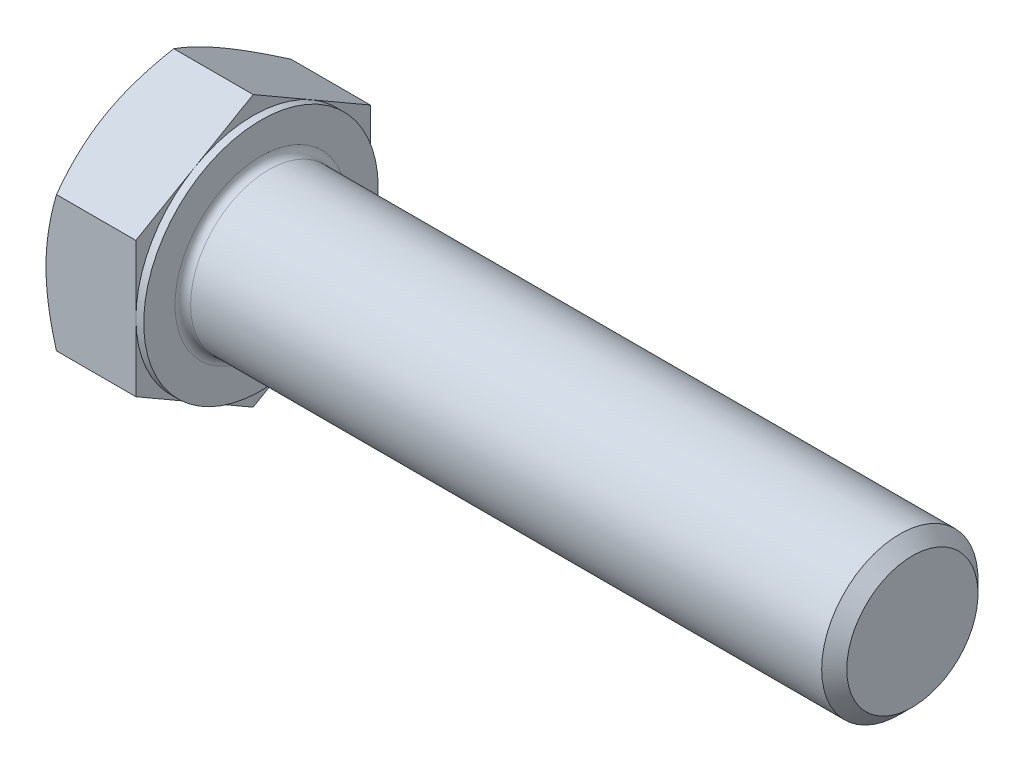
ISO-10303-21;
HEADER;
FILE_DESCRIPTION(('STEP AP214'),'2;1');
FILE_NAME('part.step','',(''),(''),'','','');
FILE_SCHEMA(('AUTOMOTIVE_DESIGN { 1 0 10303 214 1 1 1 1 }'));
ENDSEC;
DATA;
#1=APPLICATION_CONTEXT('core data for automotive mechanical design processes');
#2=APPLICATION_PROTOCOL_DEFINITION('international standard','automotive_design',2000,#1);
#3=PRODUCT_CONTEXT('',#1,'mechanical');
#4=PRODUCT('Part','Part','',(#3));
#5=PRODUCT_RELATED_PRODUCT_CATEGORY('part','',(#4));
#6=PRODUCT_DEFINITION_FORMATION('','',#4);
#7=PRODUCT_DEFINITION_CONTEXT('part definition',#1,'design');
#8=PRODUCT_DEFINITION('design','',#6,#7);
#9=PRODUCT_DEFINITION_SHAPE('','',#8);
#10=(LENGTH_UNIT() NAMED_UNIT(*) SI_UNIT(.MILLI.,.METRE.));
#11=(NAMED_UNIT(*) PLANE_ANGLE_UNIT() SI_UNIT($,.RADIAN.));
#12=(NAMED_UNIT(*) SI_UNIT($,.STERADIAN.) SOLID_ANGLE_UNIT());
#13=UNCERTAINTY_MEASURE_WITH_UNIT(LENGTH_MEASURE(1.E-05),#10,'distance_accuracy_value','');
#14=(GEOMETRIC_REPRESENTATION_CONTEXT(3) GLOBAL_UNCERTAINTY_ASSIGNED_CONTEXT((#13)) GLOBAL_UNIT_ASSIGNED_CONTEXT((#10,
#11,#12)) REPRESENTATION_CONTEXT('',''));
#15=CARTESIAN_POINT('',(0.,0.,0.));
#16=DIRECTION('',(0.,0.,1.));
#17=DIRECTION('',(1.,0.,0.));
#18=AXIS2_PLACEMENT_3D('',#15,#16,#17);
#19=CARTESIAN_POINT('',(7.5,10.3923048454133,0.));
#20=DIRECTION('',(1.,0.,0.));
#21=DIRECTION('',(0.,0.,-1.));
#22=AXIS2_PLACEMENT_3D('',#19,#20,#21);
#23=PLANE('',#22);
#24=CARTESIAN_POINT('',(7.5,0.,0.));
#25=DIRECTION('',(1.,0.,0.));
#26=DIRECTION('',(0.,0.,-1.));
#27=AXIS2_PLACEMENT_3D('',#24,#25,#26);
#28=CIRCLE('',#27,6.6);
#29=CARTESIAN_POINT('',(7.5,0.,-6.6));
#30=VERTEX_POINT('',#29);
#31=EDGE_CURVE('E39',#30,#30,#28,.F.);
#32=ORIENTED_EDGE('',*,*,#31,.T.);
#33=EDGE_LOOP('',(#32));
#34=FACE_BOUND('',#33,.T.);
#35=CARTESIAN_POINT('',(7.5,0.,0.));
#36=DIRECTION('',(1.,0.,0.));
#37=DIRECTION('',(0.,0.,-1.));
#38=AXIS2_PLACEMENT_3D('',#35,#36,#37);
#39=CIRCLE('',#38,9.);
#40=CARTESIAN_POINT('',(7.5,0.,-9.));
#41=VERTEX_POINT('',#40);
#42=EDGE_CURVE('E290',#41,#41,#39,.T.);
#43=ORIENTED_EDGE('',*,*,#42,.T.);
#44=EDGE_LOOP('',(#43));
#45=FACE_BOUND('',#44,.T.);
#46=ADVANCED_FACE('F31',(#34,#45),#23,.T.);
#47=CARTESIAN_POINT('',(0.,0.,0.));
#48=DIRECTION('',(-1.,0.,0.));
#49=DIRECTION('',(0.,0.,1.));
#50=AXIS2_PLACEMENT_3D('',#47,#48,#49);
#51=CYLINDRICAL_SURFACE('',#50,6.);
#52=CARTESIAN_POINT('',(8.1,0.,0.));
#53=DIRECTION('',(1.,0.,0.));
#54=DIRECTION('',(0.,0.,-1.));
#55=AXIS2_PLACEMENT_3D('',#52,#53,#54);
#56=CIRCLE('',#55,6.);
#57=CARTESIAN_POINT('',(8.1,0.,-6.));
#58=VERTEX_POINT('',#57);
#59=EDGE_CURVE('E11',#58,#58,#56,.T.);
#60=ORIENTED_EDGE('',*,*,#59,.T.);
#61=EDGE_LOOP('',(#60));
#62=FACE_BOUND('',#61,.T.);
#63=CARTESIAN_POINT('',(56.536,0.,0.));
#64=DIRECTION('',(-1.,0.,0.));
#65=DIRECTION('',(0.,0.,1.));
#66=AXIS2_PLACEMENT_3D('',#63,#64,#65);
#67=CIRCLE('',#66,6.);
#68=CARTESIAN_POINT('',(56.536,0.,6.));
#69=VERTEX_POINT('',#68);
#70=EDGE_CURVE('E269',#69,#69,#67,.T.);
#71=ORIENTED_EDGE('',*,*,#70,.T.);
#72=EDGE_LOOP('',(#71));
#73=FACE_BOUND('',#72,.T.);
#74=ADVANCED_FACE('F243',(#62,#73),#51,.T.);
#75=CARTESIAN_POINT('',(57.5,0.,0.));
#76=DIRECTION('',(-1.,0.,0.));
#77=DIRECTION('',(0.,0.,1.));
#78=AXIS2_PLACEMENT_3D('',#75,#76,#77);
#79=CONICAL_SURFACE('',#78,5.036,0.785398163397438);
#80=ORIENTED_EDGE('',*,*,#70,.F.);
#81=EDGE_LOOP('',(#80));
#82=FACE_BOUND('',#81,.T.);
#83=CARTESIAN_POINT('',(57.5,0.,0.));
#84=DIRECTION('',(-1.,0.,0.));
#85=DIRECTION('',(0.,0.,1.));
#86=AXIS2_PLACEMENT_3D('',#83,#84,#85);
#87=CIRCLE('',#86,5.036);
#88=CARTESIAN_POINT('',(57.5,0.,5.036));
#89=VERTEX_POINT('',#88);
#90=EDGE_CURVE('E267',#89,#89,#87,.T.);
#91=ORIENTED_EDGE('',*,*,#90,.T.);
#92=EDGE_LOOP('',(#91));
#93=FACE_BOUND('',#92,.T.);
#94=ADVANCED_FACE('F248',(#82,#93),#79,.T.);
#95=CARTESIAN_POINT('',(57.5,0.,0.));
#96=DIRECTION('',(-1.,0.,0.));
#97=DIRECTION('',(0.,0.,1.));
#98=AXIS2_PLACEMENT_3D('',#95,#96,#97);
#99=PLANE('',#98);
#100=ORIENTED_EDGE('',*,*,#90,.F.);
#101=EDGE_LOOP('',(#100));
#102=FACE_BOUND('',#101,.T.);
#103=ADVANCED_FACE('F255',(#102),#99,.F.);
#104=CARTESIAN_POINT('',(6.9,9.,0.));
#105=DIRECTION('',(1.,0.,0.));
#106=DIRECTION('',(0.,0.,-1.));
#107=AXIS2_PLACEMENT_3D('',#104,#105,#106);
#108=PLANE('',#107);
#109=DIRECTION('',(0.,0.500000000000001,0.866025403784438));
#110=VECTOR('',#109,1.);
#111=CARTESIAN_POINT('',(6.9,5.19615242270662,-9.));
#112=LINE('',#111,#110);
#113=CARTESIAN_POINT('',(6.9,5.19615242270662,-9.));
#114=VERTEX_POINT('',#113);
#115=CARTESIAN_POINT('',(6.9,7.79422863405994,-4.50000000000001));
#116=VERTEX_POINT('',#115);
#117=EDGE_CURVE('E163',#114,#116,#112,.T.);
#118=ORIENTED_EDGE('',*,*,#117,.T.);
#119=CARTESIAN_POINT('',(6.9,0.,0.));
#120=DIRECTION('',(-1.,0.,0.));
#121=DIRECTION('',(0.,0.,1.));
#122=AXIS2_PLACEMENT_3D('',#119,#120,#121);
#123=CIRCLE('',#122,9.);
#124=CARTESIAN_POINT('',(6.9,0.,-9.));
#125=VERTEX_POINT('',#124);
#126=EDGE_CURVE('E46',#116,#125,#123,.T.);
#127=ORIENTED_EDGE('',*,*,#126,.T.);
#128=DIRECTION('',(0.,1.,0.));
#129=VECTOR('',#128,1.);
#130=CARTESIAN_POINT('',(6.9,5.19615242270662,-9.));
#131=LINE('',#130,#129);
#132=EDGE_CURVE('E293',#125,#114,#131,.T.);
#133=ORIENTED_EDGE('',*,*,#132,.T.);
#134=EDGE_LOOP('',(#118,#127,#133));
#135=FACE_BOUND('',#134,.T.);
#136=ADVANCED_FACE('F258',(#135),#108,.T.);
#137=CARTESIAN_POINT('',(6.9,10.3923048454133,0.));
#138=VERTEX_POINT('',#137);
#139=EDGE_CURVE('E161',#116,#138,#112,.T.);
#140=ORIENTED_EDGE('',*,*,#139,.T.);
#141=DIRECTION('',(0.,-0.500000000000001,0.866025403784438));
#142=VECTOR('',#141,1.);
#143=CARTESIAN_POINT('',(6.9,10.3923048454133,0.));
#144=LINE('',#143,#142);
#145=CARTESIAN_POINT('',(6.9,7.79422863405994,4.50000000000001));
#146=VERTEX_POINT('',#145);
#147=EDGE_CURVE('E160',#138,#146,#144,.T.);
#148=ORIENTED_EDGE('',*,*,#147,.T.);
#149=EDGE_CURVE('E149',#146,#116,#123,.T.);
#150=ORIENTED_EDGE('',*,*,#149,.T.);
#151=EDGE_LOOP('',(#140,#148,#150));
#152=FACE_BOUND('',#151,.T.);
#153=ADVANCED_FACE('F263',(#152),#108,.T.);
#154=CARTESIAN_POINT('',(6.9,5.19615242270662,9.));
#155=VERTEX_POINT('',#154);
#156=EDGE_CURVE('E128',#146,#155,#144,.T.);
#157=ORIENTED_EDGE('',*,*,#156,.T.);
#158=DIRECTION('',(0.,-1.,0.));
#159=VECTOR('',#158,1.);
#160=CARTESIAN_POINT('',(6.9,5.19615242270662,9.));
#161=LINE('',#160,#159);
#162=CARTESIAN_POINT('',(6.9,0.,9.));
#163=VERTEX_POINT('',#162);
#164=EDGE_CURVE('E122',#155,#163,#161,.T.);
#165=ORIENTED_EDGE('',*,*,#164,.T.);
#166=EDGE_CURVE('E126',#163,#146,#123,.T.);
#167=ORIENTED_EDGE('',*,*,#166,.T.);
#168=EDGE_LOOP('',(#157,#165,#167));
#169=FACE_BOUND('',#168,.T.);
#170=ADVANCED_FACE('F124',(#169),#108,.T.);
#171=CARTESIAN_POINT('',(6.9,-5.19615242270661,9.));
#172=VERTEX_POINT('',#171);
#173=EDGE_CURVE('E132',#163,#172,#161,.T.);
#174=ORIENTED_EDGE('',*,*,#173,.T.);
#175=DIRECTION('',(0.,-0.500000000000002,-0.866025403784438));
#176=VECTOR('',#175,1.);
#177=CARTESIAN_POINT('',(6.9,-10.3923048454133,0.));
#178=LINE('',#177,#176);
#179=CARTESIAN_POINT('',(6.9,-7.79422863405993,4.50000000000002));
#180=VERTEX_POINT('',#179);
#181=EDGE_CURVE('E139',#172,#180,#178,.T.);
#182=ORIENTED_EDGE('',*,*,#181,.T.);
#183=EDGE_CURVE('E136',#180,#163,#123,.T.);
#184=ORIENTED_EDGE('',*,*,#183,.T.);
#185=EDGE_LOOP('',(#174,#182,#184));
#186=FACE_BOUND('',#185,.T.);
#187=ADVANCED_FACE('F137',(#186),#108,.T.);
#188=CARTESIAN_POINT('',(6.9,-10.3923048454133,0.));
#189=VERTEX_POINT('',#188);
#190=EDGE_CURVE('E155',#180,#189,#178,.T.);
#191=ORIENTED_EDGE('',*,*,#190,.T.);
#192=DIRECTION('',(0.,0.5,-0.866025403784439));
#193=VECTOR('',#192,1.);
#194=CARTESIAN_POINT('',(6.9,-5.19615242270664,-9.));
#195=LINE('',#194,#193);
#196=CARTESIAN_POINT('',(6.9,-7.79422863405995,-4.49999999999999));
#197=VERTEX_POINT('',#196);
#198=EDGE_CURVE('E331',#189,#197,#195,.T.);
#199=ORIENTED_EDGE('',*,*,#198,.T.);
#200=EDGE_CURVE('E143',#197,#180,#123,.T.);
#201=ORIENTED_EDGE('',*,*,#200,.T.);
#202=EDGE_LOOP('',(#191,#199,#201));
#203=FACE_BOUND('',#202,.T.);
#204=ADVANCED_FACE('F332',(#203),#108,.T.);
#205=CARTESIAN_POINT('',(6.9,-5.19615242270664,-9.));
#206=VERTEX_POINT('',#205);
#207=EDGE_CURVE('E150',#197,#206,#195,.T.);
#208=ORIENTED_EDGE('',*,*,#207,.T.);
#209=EDGE_CURVE('E294',#206,#125,#131,.T.);
#210=ORIENTED_EDGE('',*,*,#209,.T.);
#211=EDGE_CURVE('E301',#125,#197,#123,.T.);
#212=ORIENTED_EDGE('',*,*,#211,.T.);
#213=EDGE_LOOP('',(#208,#210,#212));
#214=FACE_BOUND('',#213,.T.);
#215=ADVANCED_FACE('F264',(#214),#108,.T.);
#216=CARTESIAN_POINT('',(0.,0.,0.));
#217=DIRECTION('',(-1.,0.,0.));
#218=DIRECTION('',(0.,0.,1.));
#219=AXIS2_PLACEMENT_3D('',#216,#217,#218);
#220=CYLINDRICAL_SURFACE('',#219,9.);
#221=ORIENTED_EDGE('',*,*,#126,.F.);
#222=ORIENTED_EDGE('',*,*,#149,.F.);
#223=ORIENTED_EDGE('',*,*,#166,.F.);
#224=ORIENTED_EDGE('',*,*,#183,.F.);
#225=ORIENTED_EDGE('',*,*,#200,.F.);
#226=ORIENTED_EDGE('',*,*,#211,.F.);
#227=EDGE_LOOP('',(#221,#222,#223,#224,#225,#226));
#228=FACE_BOUND('',#227,.T.);
#229=ORIENTED_EDGE('',*,*,#42,.F.);
#230=EDGE_LOOP('',(#229));
#231=FACE_BOUND('',#230,.T.);
#232=ADVANCED_FACE('F146',(#228,#231),#220,.T.);
#233=CARTESIAN_POINT('',(0.,10.3923048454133,0.));
#234=DIRECTION('',(1.,0.,0.));
#235=DIRECTION('',(0.,0.,-1.));
#236=AXIS2_PLACEMENT_3D('',#233,#234,#235);
#237=PLANE('',#236);
#238=CARTESIAN_POINT('',(0.,0.,0.));
#239=DIRECTION('',(1.,0.,0.));
#240=DIRECTION('',(0.,0.,-1.));
#241=AXIS2_PLACEMENT_3D('',#238,#239,#240);
#242=CIRCLE('',#241,9.);
#243=CARTESIAN_POINT('',(0.,0.,-9.));
#244=VERTEX_POINT('',#243);
#245=CARTESIAN_POINT('',(0.,7.79422863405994,-4.50000000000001));
#246=VERTEX_POINT('',#245);
#247=EDGE_CURVE('E289',#244,#246,#242,.T.);
#248=ORIENTED_EDGE('',*,*,#247,.F.);
#249=CARTESIAN_POINT('',(0.,-7.79422863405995,-4.5));
#250=VERTEX_POINT('',#249);
#251=EDGE_CURVE('E285',#250,#244,#242,.T.);
#252=ORIENTED_EDGE('',*,*,#251,.F.);
#253=CARTESIAN_POINT('',(0.,-7.79422863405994,4.50000000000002));
#254=VERTEX_POINT('',#253);
#255=EDGE_CURVE('E288',#254,#250,#242,.T.);
#256=ORIENTED_EDGE('',*,*,#255,.F.);
#257=CARTESIAN_POINT('',(0.,0.,9.));
#258=VERTEX_POINT('',#257);
#259=EDGE_CURVE('E324',#258,#254,#242,.T.);
#260=ORIENTED_EDGE('',*,*,#259,.F.);
#261=CARTESIAN_POINT('',(0.,0.,0.));
#262=DIRECTION('',(-1.,0.,0.));
#263=DIRECTION('',(0.,0.,1.));
#264=AXIS2_PLACEMENT_3D('',#261,#262,#263);
#265=CIRCLE('',#264,9.);
#266=CARTESIAN_POINT('',(0.,7.79422863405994,4.50000000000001));
#267=VERTEX_POINT('',#266);
#268=EDGE_CURVE('E164',#258,#267,#265,.T.);
#269=ORIENTED_EDGE('',*,*,#268,.T.);
#270=EDGE_CURVE('E347',#246,#267,#242,.T.);
#271=ORIENTED_EDGE('',*,*,#270,.F.);
#272=EDGE_LOOP('',(#248,#252,#256,#260,#269,#271));
#273=FACE_BOUND('',#272,.T.);
#274=ADVANCED_FACE('F193',(#273),#237,.F.);
#275=CARTESIAN_POINT('',(0.,0.,0.));
#276=DIRECTION('',(1.,0.,0.));
#277=DIRECTION('',(0.,0.,-1.));
#278=AXIS2_PLACEMENT_3D('',#275,#276,#277);
#279=CONICAL_SURFACE('',#278,9.,1.0471975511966);
#280=CARTESIAN_POINT('',(0.803914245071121,5.19603695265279,9.0002));
#281=CARTESIAN_POINT('',(0.737982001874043,5.31024090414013,8.80239295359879));
#282=CARTESIAN_POINT('',(0.675041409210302,5.42489028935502,8.60381439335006));
#283=CARTESIAN_POINT('',(0.555968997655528,5.65512011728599,8.20504463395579));
#284=CARTESIAN_POINT('',(0.499840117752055,5.77070093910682,8.00485277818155));
#285=CARTESIAN_POINT('',(0.395151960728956,6.00300811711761,7.60248494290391));
#286=CARTESIAN_POINT('',(0.34661077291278,6.11973652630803,7.40030540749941));
#287=CARTESIAN_POINT('',(0.258148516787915,6.35398725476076,6.99457124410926));
#288=CARTESIAN_POINT('',(0.218225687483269,6.47150940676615,6.7910169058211));
#289=CARTESIAN_POINT('',(0.148684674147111,6.70436794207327,6.38769409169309));
#290=CARTESIAN_POINT('',(0.118837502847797,6.81968712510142,6.187955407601));
#291=CARTESIAN_POINT('',(0.0687933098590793,7.05084147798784,5.78758432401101));
#292=CARTESIAN_POINT('',(0.0485954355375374,7.16667660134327,5.5869520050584));
#293=CARTESIAN_POINT('',(0.0183543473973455,7.39854776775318,5.18533936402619));
#294=CARTESIAN_POINT('',(0.0082996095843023,7.51458343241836,4.98435969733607));
#295=CARTESIAN_POINT('',(-0.0014376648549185,7.74676155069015,4.58221540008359));
#296=CARTESIAN_POINT('',(-0.00112052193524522,7.86290400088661,4.38105077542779));
#297=CARTESIAN_POINT('',(0.00916395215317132,8.08003584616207,4.00496738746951));
#298=CARTESIAN_POINT('',(0.0178767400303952,8.18104055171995,3.83002210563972));
#299=CARTESIAN_POINT('',(0.0429773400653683,8.38281337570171,3.48054132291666));
#300=CARTESIAN_POINT('',(0.0593656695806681,8.4835814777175,3.30600585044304));
#301=CARTESIAN_POINT('',(0.119656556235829,8.7854956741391,2.7830751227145));
#302=CARTESIAN_POINT('',(0.174677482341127,8.98610736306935,2.43560548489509));
#303=CARTESIAN_POINT('',(0.312230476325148,9.38945876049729,1.736980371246));
#304=CARTESIAN_POINT('',(0.395345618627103,9.59214699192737,1.38591405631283));
#305=CARTESIAN_POINT('',(0.583982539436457,9.99450087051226,0.689016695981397));
#306=CARTESIAN_POINT('',(0.689460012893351,10.1941716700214,0.343176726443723));
#307=CARTESIAN_POINT('',(0.803914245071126,10.3924203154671,-0.000200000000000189));
#308=B_SPLINE_CURVE_WITH_KNOTS('',3,(#280,#281,#282,#283,#284,#285,#286,#287,#288,#289,#290,
#291,#292,#293,#294,#295,#296,#297,#298,#299,#300,#301,#302,#303,#304,#305,#306,#307),
.UNSPECIFIED.,.F.,.F.,(4,2,2,2,2,2,2,2,2,2,2,2,2,4),(0.,0.713219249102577,1.42674513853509,
2.14194697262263,2.8570025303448,3.55449749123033,4.25193080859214,4.94857085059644,
5.64518936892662,6.25162976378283,6.8581110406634,8.07193747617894,9.31268391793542,
10.5509947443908),.UNSPECIFIED.);
#309=CARTESIAN_POINT('',(0.80384757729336,10.3923048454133,0.));
#310=VERTEX_POINT('',#309);
#311=EDGE_CURVE('E212',#267,#310,#308,.T.);
#312=ORIENTED_EDGE('',*,*,#311,.T.);
#313=CARTESIAN_POINT('',(0.803914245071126,10.3924203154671,0.000200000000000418));
#314=CARTESIAN_POINT('',(0.737982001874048,10.2782163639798,-0.197607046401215));
#315=CARTESIAN_POINT('',(0.675041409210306,10.1635669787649,-0.396185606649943));
#316=CARTESIAN_POINT('',(0.555968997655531,9.93333715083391,-0.794955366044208));
#317=CARTESIAN_POINT('',(0.499840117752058,9.81775632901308,-0.995147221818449));
#318=CARTESIAN_POINT('',(0.395151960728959,9.58544915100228,-1.39751505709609));
#319=CARTESIAN_POINT('',(0.346610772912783,9.46872074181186,-1.59969459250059));
#320=CARTESIAN_POINT('',(0.258148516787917,9.23447001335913,-2.00542875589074));
#321=CARTESIAN_POINT('',(0.218225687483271,9.11694786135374,-2.20898309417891));
#322=CARTESIAN_POINT('',(0.148684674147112,8.88408932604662,-2.61230590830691));
#323=CARTESIAN_POINT('',(0.118837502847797,8.76877014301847,-2.812044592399));
#324=CARTESIAN_POINT('',(0.0687933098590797,8.53761579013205,-3.21241567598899));
#325=CARTESIAN_POINT('',(0.0485954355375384,8.42178066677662,-3.4130479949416));
#326=CARTESIAN_POINT('',(0.0183543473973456,8.18990950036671,-3.81466063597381));
#327=CARTESIAN_POINT('',(0.00829960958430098,8.07387383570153,-4.01564030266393));
#328=CARTESIAN_POINT('',(-0.00143766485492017,7.84169571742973,-4.41778459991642));
#329=CARTESIAN_POINT('',(-0.00112052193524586,7.72555326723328,-4.61894922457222));
#330=CARTESIAN_POINT('',(0.00916395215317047,7.50842142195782,-4.9950326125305));
#331=CARTESIAN_POINT('',(0.0178767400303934,7.40741671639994,-5.16997789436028));
#332=CARTESIAN_POINT('',(0.0429773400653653,7.20564389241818,-5.51945867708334));
#333=CARTESIAN_POINT('',(0.059365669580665,7.10487579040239,-5.69399414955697));
#334=CARTESIAN_POINT('',(0.119656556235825,6.80296159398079,-6.2169248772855));
#335=CARTESIAN_POINT('',(0.174677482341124,6.60234990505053,-6.56439451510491));
#336=CARTESIAN_POINT('',(0.312230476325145,6.1989985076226,-7.263019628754));
#337=CARTESIAN_POINT('',(0.3953456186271,5.99631027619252,-7.61408594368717));
#338=CARTESIAN_POINT('',(0.583982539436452,5.59395639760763,-8.3109833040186));
#339=CARTESIAN_POINT('',(0.689460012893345,5.39428559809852,-8.65682327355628));
#340=CARTESIAN_POINT('',(0.803914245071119,5.19603695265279,-9.0002));
#341=B_SPLINE_CURVE_WITH_KNOTS('',3,(#313,#314,#315,#316,#317,#318,#319,#320,#321,#322,#323,
#324,#325,#326,#327,#328,#329,#330,#331,#332,#333,#334,#335,#336,#337,#338,#339,#340),
.UNSPECIFIED.,.F.,.F.,(4,2,2,2,2,2,2,2,2,2,2,2,2,4),(0.,0.713219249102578,1.42674513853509,
2.14194697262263,2.8570025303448,3.55449749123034,4.25193080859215,4.94857085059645,
5.64518936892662,6.25162976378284,6.8581110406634,8.07193747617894,9.31268391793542,
10.5509947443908),.UNSPECIFIED.);
#342=EDGE_CURVE('E54',#310,#246,#341,.T.);
#343=ORIENTED_EDGE('',*,*,#342,.T.);
#344=ORIENTED_EDGE('',*,*,#270,.T.);
#345=EDGE_LOOP('',(#312,#343,#344));
#346=FACE_BOUND('',#345,.T.);
#347=ADVANCED_FACE('F348',(#346),#279,.T.);
#348=CARTESIAN_POINT('',(4.50308345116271,-14.1853984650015,8.99999999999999));
#349=CARTESIAN_POINT('',(4.31054430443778,-13.7903499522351,8.99999999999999));
#350=CARTESIAN_POINT('',(4.11978647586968,-13.3944187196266,8.99999999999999));
#351=CARTESIAN_POINT('',(3.74283090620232,-12.6003222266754,8.99999999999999));
#352=CARTESIAN_POINT('',(3.55663384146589,-12.2021566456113,9.));
#353=CARTESIAN_POINT('',(3.18890856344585,-11.4011783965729,9.));
#354=CARTESIAN_POINT('',(3.00740939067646,-10.9983523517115,9.));
#355=CARTESIAN_POINT('',(2.65153988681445,-10.1895752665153,9.));
#356=CARTESIAN_POINT('',(2.4771692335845,-9.78362436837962,9.));
#357=CARTESIAN_POINT('',(2.13161244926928,-8.953981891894,9.));
#358=CARTESIAN_POINT('',(1.96074001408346,-8.53015895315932,9.));
#359=CARTESIAN_POINT('',(1.63138410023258,-7.6776404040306,9.));
#360=CARTESIAN_POINT('',(1.47290197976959,-7.24894426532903,9.));
#361=CARTESIAN_POINT('',(1.17232155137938,-6.38672363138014,9.));
#362=CARTESIAN_POINT('',(1.03019194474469,-5.95321016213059,9.));
#363=CARTESIAN_POINT('',(0.766724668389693,-5.07998336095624,9.));
#364=CARTESIAN_POINT('',(0.645380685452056,-4.64027195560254,9.));
#365=CARTESIAN_POINT('',(0.429822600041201,-3.75682505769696,9.));
#366=CARTESIAN_POINT('',(0.335452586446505,-3.31312863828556,9.));
#367=CARTESIAN_POINT('',(0.218090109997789,-2.64336713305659,9.));
#368=CARTESIAN_POINT('',(0.182999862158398,-2.41939560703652,9.));
#369=CARTESIAN_POINT('',(0.121565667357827,-1.9702635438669,9.));
#370=CARTESIAN_POINT('',(0.0952208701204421,-1.74510312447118,9.));
#371=CARTESIAN_POINT('',(0.0521451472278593,-1.29693480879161,9.));
#372=CARTESIAN_POINT('',(0.0352889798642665,-1.07393900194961,9.));
#373=CARTESIAN_POINT('',(0.0110310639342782,-0.627433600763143,9.));
#374=CARTESIAN_POINT('',(0.00362915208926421,-0.403924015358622,9.));
#375=CARTESIAN_POINT('',(-0.00154262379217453,0.0432079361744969,9.));
#376=CARTESIAN_POINT('',(0.000687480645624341,0.266830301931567,9.));
#377=CARTESIAN_POINT('',(0.0147226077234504,0.713776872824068,9.));
#378=CARTESIAN_POINT('',(0.0265280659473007,0.937101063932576,9.));
#379=CARTESIAN_POINT('',(0.065650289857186,1.46707211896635,9.));
#380=CARTESIAN_POINT('',(0.0971347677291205,1.77341845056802,9.));
#381=CARTESIAN_POINT('',(0.176454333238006,2.38397028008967,9.));
#382=CARTESIAN_POINT('',(0.224291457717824,2.68817550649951,9.));
#383=CARTESIAN_POINT('',(0.389806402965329,3.59715813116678,9.));
#384=CARTESIAN_POINT('',(0.529461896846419,4.19799412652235,9.));
#385=CARTESIAN_POINT('',(0.773331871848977,5.09670706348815,9.));
#386=CARTESIAN_POINT('',(0.861532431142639,5.399199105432,9.));
#387=CARTESIAN_POINT('',(1.04752099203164,6.00125026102,9.));
#388=CARTESIAN_POINT('',(1.14530906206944,6.3008093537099,9.));
#389=CARTESIAN_POINT('',(1.34886866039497,6.89708058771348,9.));
#390=CARTESIAN_POINT('',(1.45463787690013,7.19379352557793,9.));
#391=CARTESIAN_POINT('',(1.67287301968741,7.78473287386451,9.));
#392=CARTESIAN_POINT('',(1.78533883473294,8.07895932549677,9.));
#393=CARTESIAN_POINT('',(2.07523735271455,8.81619444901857,9.));
#394=CARTESIAN_POINT('',(2.25629467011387,9.25777584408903,9.));
#395=CARTESIAN_POINT('',(2.62827522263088,10.1367776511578,9.));
#396=CARTESIAN_POINT('',(2.81919928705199,10.5741977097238,9.));
#397=CARTESIAN_POINT('',(3.20877963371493,11.4457286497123,9.));
#398=CARTESIAN_POINT('',(3.40743823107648,11.8798384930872,9.));
#399=CARTESIAN_POINT('',(3.81079737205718,12.7452179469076,9.));
#400=CARTESIAN_POINT('',(4.01549773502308,13.176487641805,9.00000000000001));
#401=CARTESIAN_POINT('',(4.43000777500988,14.0372827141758,9.00000000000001));
#402=CARTESIAN_POINT('',(4.63982402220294,14.466804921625,9.00000000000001));
#403=CARTESIAN_POINT('',(5.0633687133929,15.3239162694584,9.00000000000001));
#404=CARTESIAN_POINT('',(5.27709718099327,15.7515053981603,9.00000000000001));
#405=CARTESIAN_POINT('',(5.70771289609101,16.6049951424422,9.00000000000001));
#406=CARTESIAN_POINT('',(5.92459958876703,17.0308960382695,9.00000000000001));
#407=CARTESIAN_POINT('',(6.36101693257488,17.8813418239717,9.00000000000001));
#408=CARTESIAN_POINT('',(6.58054759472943,18.305886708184,9.00000000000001));
#409=CARTESIAN_POINT('',(7.2009668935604,19.4981240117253,9.00000000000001));
#410=CARTESIAN_POINT('',(7.60436223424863,20.2645118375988,9.00000000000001));
#411=CARTESIAN_POINT('',(8.41646747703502,21.7945065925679,9.00000000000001));
#412=CARTESIAN_POINT('',(8.82517763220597,22.558113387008,9.00000000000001));
#413=CARTESIAN_POINT('',(9.64538992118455,24.0808854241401,9.00000000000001));
#414=CARTESIAN_POINT('',(10.0568800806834,24.8400571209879,9.00000000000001));
#415=CARTESIAN_POINT('',(10.6764233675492,25.9775231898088,9.00000000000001));
#416=CARTESIAN_POINT('',(10.8833155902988,26.3564507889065,9.00000000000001));
#417=CARTESIAN_POINT('',(11.2977907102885,27.1139273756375,9.00000000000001));
#418=CARTESIAN_POINT('',(11.5053736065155,27.492476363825,9.00000000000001));
#419=CARTESIAN_POINT('',(11.7132605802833,27.8708583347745,9.00000000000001));
#420=B_SPLINE_CURVE_WITH_KNOTS('',3,(#348,#349,#350,#351,#352,#353,#354,#355,#356,#357,#358,
#359,#360,#361,#362,#363,#364,#365,#366,#367,#368,#369,#370,#371,#372,#373,#374,#375,#376,#377,
#378,#379,#380,#381,#382,#383,#384,#385,#386,#387,#388,#389,#390,#391,#392,#393,#394,#395,#396,
#397,#398,#399,#400,#401,#402,#403,#404,#405,#406,#407,#408,#409,#410,#411,#412,#413,#414,#415,
#416,#417,#418,#419),.UNSPECIFIED.,.F.,.F.,(4,2,2,2,2,2,2,2,2,2,2,2,2,2,2,2,2,2,2,2,2,2,2,2,2,2,
2,2,2,2,2,2,2,2,2,4),(0.,1.31842765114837,2.6370496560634,3.96247407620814,5.28783853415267,
6.65860358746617,8.02951869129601,9.39776460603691,10.7655942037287,12.1253499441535,
12.8053173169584,13.4852185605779,14.1559216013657,14.8266130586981,15.4973023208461,
16.1680220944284,17.0913849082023,18.0148627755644,19.862742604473,20.8079230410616,
21.7531102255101,22.6980246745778,23.6429234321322,25.0745302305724,26.5062575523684,
27.9384167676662,29.3705332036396,30.8045973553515,32.2386701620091,33.6724940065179,
35.1063238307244,37.7045032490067,40.3028068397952,42.8933552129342,44.1885437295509,
45.4837303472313),.UNSPECIFIED.);
#421=CARTESIAN_POINT('',(0.803847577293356,5.19615242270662,9.));
#422=VERTEX_POINT('',#421);
#423=EDGE_CURVE('E224',#258,#422,#420,.T.);
#424=ORIENTED_EDGE('',*,*,#423,.T.);
#425=EDGE_CURVE('E223',#422,#267,#308,.T.);
#426=ORIENTED_EDGE('',*,*,#425,.T.);
#427=ORIENTED_EDGE('',*,*,#268,.F.);
#428=EDGE_LOOP('',(#424,#426,#427));
#429=FACE_BOUND('',#428,.T.);
#430=ADVANCED_FACE('F318',(#429),#279,.T.);
#431=CARTESIAN_POINT('',(0.80384757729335,-5.19615242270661,9.));
#432=VERTEX_POINT('',#431);
#433=EDGE_CURVE('E270',#432,#258,#420,.T.);
#434=ORIENTED_EDGE('',*,*,#433,.T.);
#435=ORIENTED_EDGE('',*,*,#259,.T.);
#436=CARTESIAN_POINT('',(0.803914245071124,-10.3924203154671,-0.000200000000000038));
#437=CARTESIAN_POINT('',(0.737982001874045,-10.2782163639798,0.197607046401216));
#438=CARTESIAN_POINT('',(0.675041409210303,-10.1635669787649,0.396185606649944));
#439=CARTESIAN_POINT('',(0.555968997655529,-9.9333371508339,0.794955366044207));
#440=CARTESIAN_POINT('',(0.499840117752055,-9.81775632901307,0.995147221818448));
#441=CARTESIAN_POINT('',(0.395151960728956,-9.58544915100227,1.39751505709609));
#442=CARTESIAN_POINT('',(0.34661077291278,-9.46872074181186,1.59969459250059));
#443=CARTESIAN_POINT('',(0.258148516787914,-9.23447001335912,2.00542875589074));
#444=CARTESIAN_POINT('',(0.218225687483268,-9.11694786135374,2.20898309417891));
#445=CARTESIAN_POINT('',(0.148684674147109,-8.88408932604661,2.61230590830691));
#446=CARTESIAN_POINT('',(0.118837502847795,-8.76877014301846,2.812044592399));
#447=CARTESIAN_POINT('',(0.0687933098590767,-8.53761579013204,3.21241567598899));
#448=CARTESIAN_POINT('',(0.048595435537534,-8.42178066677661,3.4130479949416));
#449=CARTESIAN_POINT('',(0.0183543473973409,-8.18990950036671,3.81466063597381));
#450=CARTESIAN_POINT('',(0.0082996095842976,-8.07387383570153,4.01564030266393));
#451=CARTESIAN_POINT('',(-0.00143766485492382,-7.84169571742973,4.41778459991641));
#452=CARTESIAN_POINT('',(-0.00112052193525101,-7.72555326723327,4.61894922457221));
#453=CARTESIAN_POINT('',(0.00916395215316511,-7.50842142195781,4.99503261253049));
#454=CARTESIAN_POINT('',(0.017876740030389,-7.40741671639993,5.16997789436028));
#455=CARTESIAN_POINT('',(0.0429773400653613,-7.20564389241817,5.51945867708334));
#456=CARTESIAN_POINT('',(0.0593656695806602,-7.10487579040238,5.69399414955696));
#457=CARTESIAN_POINT('',(0.119656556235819,-6.80296159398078,6.2169248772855));
#458=CARTESIAN_POINT('',(0.174677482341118,-6.60234990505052,6.56439451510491));
#459=CARTESIAN_POINT('',(0.312230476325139,-6.19899850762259,7.26301962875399));
#460=CARTESIAN_POINT('',(0.395345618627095,-5.99631027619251,7.61408594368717));
#461=CARTESIAN_POINT('',(0.583982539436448,-5.59395639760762,8.3109833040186));
#462=CARTESIAN_POINT('',(0.689460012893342,-5.39428559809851,8.65682327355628));
#463=CARTESIAN_POINT('',(0.803914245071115,-5.19603695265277,9.0002));
#464=B_SPLINE_CURVE_WITH_KNOTS('',3,(#436,#437,#438,#439,#440,#441,#442,#443,#444,#445,#446,
#447,#448,#449,#450,#451,#452,#453,#454,#455,#456,#457,#458,#459,#460,#461,#462,#463),
.UNSPECIFIED.,.F.,.F.,(4,2,2,2,2,2,2,2,2,2,2,2,2,4),(0.,0.713219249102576,1.42674513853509,
2.14194697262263,2.8570025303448,3.55449749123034,4.25193080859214,4.94857085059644,
5.64518936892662,6.25162976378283,6.8581110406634,8.07193747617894,9.31268391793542,
10.5509947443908),.UNSPECIFIED.);
#465=EDGE_CURVE('E214',#254,#432,#464,.T.);
#466=ORIENTED_EDGE('',*,*,#465,.T.);
#467=EDGE_LOOP('',(#434,#435,#466));
#468=FACE_BOUND('',#467,.T.);
#469=ADVANCED_FACE('F182',(#468),#279,.T.);
#470=CARTESIAN_POINT('',(0.803847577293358,-10.3923048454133,0.));
#471=VERTEX_POINT('',#470);
#472=EDGE_CURVE('E207',#471,#254,#464,.T.);
#473=ORIENTED_EDGE('',*,*,#472,.T.);
#474=ORIENTED_EDGE('',*,*,#255,.T.);
#475=CARTESIAN_POINT('',(0.803914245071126,-5.1960369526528,-9.0002));
#476=CARTESIAN_POINT('',(0.737982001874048,-5.31024090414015,-8.80239295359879));
#477=CARTESIAN_POINT('',(0.675041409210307,-5.42489028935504,-8.60381439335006));
#478=CARTESIAN_POINT('',(0.555968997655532,-5.655120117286,-8.20504463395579));
#479=CARTESIAN_POINT('',(0.499840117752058,-5.77070093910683,-8.00485277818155));
#480=CARTESIAN_POINT('',(0.395151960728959,-6.00300811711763,-7.6024849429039));
#481=CARTESIAN_POINT('',(0.346610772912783,-6.11973652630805,-7.4003054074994));
#482=CARTESIAN_POINT('',(0.258148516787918,-6.35398725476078,-6.99457124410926));
#483=CARTESIAN_POINT('',(0.218225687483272,-6.47150940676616,-6.79101690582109));
#484=CARTESIAN_POINT('',(0.148684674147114,-6.70436794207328,-6.38769409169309));
#485=CARTESIAN_POINT('',(0.1188375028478,-6.81968712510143,-6.187955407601));
#486=CARTESIAN_POINT('',(0.0687933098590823,-7.05084147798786,-5.78758432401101));
#487=CARTESIAN_POINT('',(0.04859543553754,-7.16667660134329,-5.58695200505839));
#488=CARTESIAN_POINT('',(0.018354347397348,-7.39854776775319,-5.18533936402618));
#489=CARTESIAN_POINT('',(0.00829960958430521,-7.51458343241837,-4.98435969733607));
#490=CARTESIAN_POINT('',(-0.00143766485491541,-7.74676155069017,-4.58221540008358));
#491=CARTESIAN_POINT('',(-0.00112052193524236,-7.86290400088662,-4.38105077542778));
#492=CARTESIAN_POINT('',(0.00916395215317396,-8.08003584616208,-4.0049673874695));
#493=CARTESIAN_POINT('',(0.0178767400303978,-8.18104055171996,-3.83002210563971));
#494=CARTESIAN_POINT('',(0.0429773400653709,-8.38281337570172,-3.48054132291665));
#495=CARTESIAN_POINT('',(0.0593656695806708,-8.48358147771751,-3.30600585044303));
#496=CARTESIAN_POINT('',(0.119656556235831,-8.7854956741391,-2.7830751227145));
#497=CARTESIAN_POINT('',(0.174677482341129,-8.98610736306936,-2.43560548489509));
#498=CARTESIAN_POINT('',(0.312230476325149,-9.38945876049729,-1.736980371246));
#499=CARTESIAN_POINT('',(0.395345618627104,-9.59214699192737,-1.38591405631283));
#500=CARTESIAN_POINT('',(0.583982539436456,-9.99450087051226,-0.689016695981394));
#501=CARTESIAN_POINT('',(0.68946001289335,-10.1941716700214,-0.343176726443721));
#502=CARTESIAN_POINT('',(0.803914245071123,-10.3924203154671,0.00019999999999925));
#503=B_SPLINE_CURVE_WITH_KNOTS('',3,(#475,#476,#477,#478,#479,#480,#481,#482,#483,#484,#485,
#486,#487,#488,#489,#490,#491,#492,#493,#494,#495,#496,#497,#498,#499,#500,#501,#502),
.UNSPECIFIED.,.F.,.F.,(4,2,2,2,2,2,2,2,2,2,2,2,2,4),(0.,0.713219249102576,1.42674513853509,
2.14194697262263,2.8570025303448,3.55449749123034,4.25193080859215,4.94857085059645,
5.64518936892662,6.25162976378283,6.8581110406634,8.07193747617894,9.31268391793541,
10.5509947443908),.UNSPECIFIED.);
#504=EDGE_CURVE('E213',#250,#471,#503,.T.);
#505=ORIENTED_EDGE('',*,*,#504,.T.);
#506=EDGE_LOOP('',(#473,#474,#505));
#507=FACE_BOUND('',#506,.T.);
#508=ADVANCED_FACE('F346',(#507),#279,.T.);
#509=CARTESIAN_POINT('',(0.803847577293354,5.19615242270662,-9.));
#510=VERTEX_POINT('',#509);
#511=EDGE_CURVE('E215',#246,#510,#341,.T.);
#512=ORIENTED_EDGE('',*,*,#511,.T.);
#513=CARTESIAN_POINT('',(4.50308345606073,-14.1853984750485,-9.));
#514=CARTESIAN_POINT('',(4.31054430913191,-13.7903499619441,-9.));
#515=CARTESIAN_POINT('',(4.11978648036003,-13.3944187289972,-9.));
#516=CARTESIAN_POINT('',(3.74283091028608,-12.6003222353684,-9.));
#517=CARTESIAN_POINT('',(3.55663384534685,-12.2021566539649,-9.));
#518=CARTESIAN_POINT('',(3.18890856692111,-11.4011784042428,-9.));
#519=CARTESIAN_POINT('',(3.00740939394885,-10.998352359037,-9.));
#520=CARTESIAN_POINT('',(2.65153988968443,-10.1895752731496,-9.));
#521=CARTESIAN_POINT('',(2.47716923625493,-9.78362437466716,-9.));
#522=CARTESIAN_POINT('',(2.13161245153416,-8.9539818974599,-9.));
#523=CARTESIAN_POINT('',(1.96074001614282,-8.53015895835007,-9.));
#524=CARTESIAN_POINT('',(1.63138410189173,-7.67764040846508,-9.));
#525=CARTESIAN_POINT('',(1.47290198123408,-7.24894426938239,-9.));
#526=CARTESIAN_POINT('',(1.17232155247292,-6.38672363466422,-9.));
#527=CARTESIAN_POINT('',(1.0301919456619,-5.95321016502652,-9.));
#528=CARTESIAN_POINT('',(0.766724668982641,-5.07998336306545,-9.));
#529=CARTESIAN_POINT('',(0.645380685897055,-4.64027195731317,-9.));
#530=CARTESIAN_POINT('',(0.429822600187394,-3.75682505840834,-9.));
#531=CARTESIAN_POINT('',(0.335452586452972,-3.31312863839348,-9.));
#532=CARTESIAN_POINT('',(0.218090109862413,-2.64336713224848,-9.));
#533=CARTESIAN_POINT('',(0.182999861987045,-2.41939560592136,-9.));
#534=CARTESIAN_POINT('',(0.12156566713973,-1.97026354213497,-9.));
#535=CARTESIAN_POINT('',(0.0952208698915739,-1.74510312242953,-9.));
#536=CARTESIAN_POINT('',(0.052145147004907,-1.29693480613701,-9.));
#537=CARTESIAN_POINT('',(0.0352889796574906,-1.07393899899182,-9.));
#538=CARTESIAN_POINT('',(0.0110310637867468,-0.62743359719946,-9.));
#539=CARTESIAN_POINT('',(0.00362915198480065,-0.403924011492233,-9.));
#540=CARTESIAN_POINT('',(-0.00154262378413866,0.0432079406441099,-9.));
#541=CARTESIAN_POINT('',(0.000687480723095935,0.266830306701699,-9.));
#542=CARTESIAN_POINT('',(0.0147226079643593,0.713776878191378,-9.));
#543=CARTESIAN_POINT('',(0.0265280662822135,0.937101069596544,-9.));
#544=CARTESIAN_POINT('',(0.0656502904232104,1.46707212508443,-9.));
#545=CARTESIAN_POINT('',(0.0971347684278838,1.77341845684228,-9.));
#546=CARTESIAN_POINT('',(0.176454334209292,2.3839702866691,-9.));
#547=CARTESIAN_POINT('',(0.224291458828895,2.68817551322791,-9.));
#548=CARTESIAN_POINT('',(0.389806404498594,3.59715813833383,-9.));
#549=CARTESIAN_POINT('',(0.529461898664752,4.19799413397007,-9.));
#550=CARTESIAN_POINT('',(0.773331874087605,5.09670707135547,-9.));
#551=CARTESIAN_POINT('',(0.861532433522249,5.39919911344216,-9.));
#552=CARTESIAN_POINT('',(1.04752099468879,6.0012502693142,-9.));
#553=CARTESIAN_POINT('',(1.14530906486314,6.30080936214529,-9.));
#554=CARTESIAN_POINT('',(1.34886866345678,6.89708059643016,-9.));
#555=CARTESIAN_POINT('',(1.45463788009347,7.19379353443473,-9.));
#556=CARTESIAN_POINT('',(1.67287302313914,7.78473288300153,-9.));
#557=CARTESIAN_POINT('',(1.78533883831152,8.07895933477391,-9.));
#558=CARTESIAN_POINT('',(2.07523735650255,8.81619445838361,-9.));
#559=CARTESIAN_POINT('',(2.25629467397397,9.25777585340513,-9.));
#560=CARTESIAN_POINT('',(2.62827522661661,10.136777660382,-9.));
#561=CARTESIAN_POINT('',(2.81919929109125,10.5741977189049,-9.));
#562=CARTESIAN_POINT('',(3.20877963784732,11.445728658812,-9.));
#563=CARTESIAN_POINT('',(3.40743823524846,11.8798385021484,-9.));
#564=CARTESIAN_POINT('',(3.81079737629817,12.745217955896,-9.));
#565=CARTESIAN_POINT('',(4.01549773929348,13.176487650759,-9.));
#566=CARTESIAN_POINT('',(4.43000777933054,14.0372827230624,-9.));
#567=CARTESIAN_POINT('',(4.63982402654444,14.4668049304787,-9.));
#568=CARTESIAN_POINT('',(5.06336871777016,15.3239162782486,-9.));
#569=CARTESIAN_POINT('',(5.27709718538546,15.7515054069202,-9.));
#570=CARTESIAN_POINT('',(5.70771290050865,16.6049951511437,-9.));
#571=CARTESIAN_POINT('',(5.9245995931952,17.030896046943,-9.));
#572=CARTESIAN_POINT('',(6.36101693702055,17.8813418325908,-9.));
#573=CARTESIAN_POINT('',(6.58054759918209,18.3058867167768,-9.));
#574=CARTESIAN_POINT('',(7.20096689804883,19.4981240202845,-9.));
#575=CARTESIAN_POINT('',(7.60436223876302,20.2645118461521,-9.));
#576=CARTESIAN_POINT('',(8.41646748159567,21.794506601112,-9.));
#577=CARTESIAN_POINT('',(8.82517763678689,22.558113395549,-9.));
#578=CARTESIAN_POINT('',(9.64538992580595,24.0808854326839,-9.));
#579=CARTESIAN_POINT('',(10.0568800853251,24.8400571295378,-9.));
#580=CARTESIAN_POINT('',(10.6764233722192,25.977523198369,-9.));
#581=CARTESIAN_POINT('',(10.883315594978,26.3564507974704,-9.));
#582=CARTESIAN_POINT('',(11.2977907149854,27.113927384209,-9.));
#583=CARTESIAN_POINT('',(11.505373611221,27.4924763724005,-9.));
#584=CARTESIAN_POINT('',(11.713260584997,27.8708583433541,-9.));
#585=B_SPLINE_CURVE_WITH_KNOTS('',3,(#513,#514,#515,#516,#517,#518,#519,#520,#521,#522,#523,
#524,#525,#526,#527,#528,#529,#530,#531,#532,#533,#534,#535,#536,#537,#538,#539,#540,#541,#542,
#543,#544,#545,#546,#547,#548,#549,#550,#551,#552,#553,#554,#555,#556,#557,#558,#559,#560,#561,
#562,#563,#564,#565,#566,#567,#568,#569,#570,#571,#572,#573,#574,#575,#576,#577,#578,#579,#580,
#581,#582,#583,#584),.UNSPECIFIED.,.F.,.F.,(4,2,2,2,2,2,2,2,2,2,2,2,2,2,2,2,2,2,2,2,2,2,2,2,2,2,
2,2,2,2,2,2,2,2,2,4),(0.,1.3184276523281,2.63704965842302,3.96247407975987,5.28783853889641,
6.65860359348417,8.02951869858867,9.39776461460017,10.7655942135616,12.1253499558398,
12.8053173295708,13.4852185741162,14.1559216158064,14.8266130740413,15.497302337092,
16.1680221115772,17.0913849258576,18.0148627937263,19.8627426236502,20.8079230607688,
21.7531102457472,22.6980246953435,23.6429234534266,25.0745302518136,26.506257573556,
27.9384167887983,29.3705332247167,30.804597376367,32.2386701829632,33.6724940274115,
35.1063238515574,37.7045032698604,40.3028068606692,42.8933552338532,44.1885437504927,
45.4837303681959),.UNSPECIFIED.);
#586=EDGE_CURVE('E175',#510,#244,#585,.F.);
#587=ORIENTED_EDGE('',*,*,#586,.T.);
#588=ORIENTED_EDGE('',*,*,#247,.T.);
#589=EDGE_LOOP('',(#512,#587,#588));
#590=FACE_BOUND('',#589,.T.);
#591=ADVANCED_FACE('F343',(#590),#279,.T.);
#592=CARTESIAN_POINT('',(0.803847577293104,-5.19615242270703,-9.));
#593=VERTEX_POINT('',#592);
#594=EDGE_CURVE('E176',#593,#250,#503,.T.);
#595=ORIENTED_EDGE('',*,*,#594,.T.);
#596=ORIENTED_EDGE('',*,*,#251,.T.);
#597=EDGE_CURVE('E167',#244,#593,#585,.F.);
#598=ORIENTED_EDGE('',*,*,#597,.T.);
#599=EDGE_LOOP('',(#595,#596,#598));
#600=FACE_BOUND('',#599,.T.);
#601=ADVANCED_FACE('F191',(#600),#279,.T.);
#602=CARTESIAN_POINT('',(7.5,5.19615242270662,-9.));
#603=DIRECTION('',(0.,0.,1.));
#604=DIRECTION('',(0.,-1.,0.));
#605=AXIS2_PLACEMENT_3D('',#602,#603,#604);
#606=PLANE('',#605);
#607=ORIENTED_EDGE('',*,*,#209,.F.);
#608=DIRECTION('',(-1.,0.,0.));
#609=VECTOR('',#608,1.);
#610=CARTESIAN_POINT('',(7.5,-5.19615242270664,-9.));
#611=LINE('',#610,#609);
#612=EDGE_CURVE('E276',#206,#593,#611,.T.);
#613=ORIENTED_EDGE('',*,*,#612,.T.);
#614=ORIENTED_EDGE('',*,*,#597,.F.);
#615=ORIENTED_EDGE('',*,*,#586,.F.);
#616=DIRECTION('',(-1.,0.,0.));
#617=VECTOR('',#616,1.);
#618=CARTESIAN_POINT('',(7.5,5.19615242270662,-9.));
#619=LINE('',#618,#617);
#620=EDGE_CURVE('E272',#114,#510,#619,.T.);
#621=ORIENTED_EDGE('',*,*,#620,.F.);
#622=ORIENTED_EDGE('',*,*,#132,.F.);
#623=EDGE_LOOP('',(#607,#613,#614,#615,#621,#622));
#624=FACE_BOUND('',#623,.T.);
#625=ADVANCED_FACE('F186',(#624),#606,.F.);
#626=CARTESIAN_POINT('',(7.5,-5.19615242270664,-9.));
#627=DIRECTION('',(0.,0.866025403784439,0.5));
#628=DIRECTION('',(0.,-0.5,0.866025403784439));
#629=AXIS2_PLACEMENT_3D('',#626,#627,#628);
#630=PLANE('',#629);
#631=ORIENTED_EDGE('',*,*,#198,.F.);
#632=DIRECTION('',(-1.,0.,0.));
#633=VECTOR('',#632,1.);
#634=CARTESIAN_POINT('',(7.5,-10.3923048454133,0.));
#635=LINE('',#634,#633);
#636=EDGE_CURVE('E278',#189,#471,#635,.T.);
#637=ORIENTED_EDGE('',*,*,#636,.T.);
#638=ORIENTED_EDGE('',*,*,#504,.F.);
#639=ORIENTED_EDGE('',*,*,#594,.F.);
#640=ORIENTED_EDGE('',*,*,#612,.F.);
#641=ORIENTED_EDGE('',*,*,#207,.F.);
#642=EDGE_LOOP('',(#631,#637,#638,#639,#640,#641));
#643=FACE_BOUND('',#642,.T.);
#644=ADVANCED_FACE('F190',(#643),#630,.F.);
#645=CARTESIAN_POINT('',(7.5,-10.3923048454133,0.));
#646=DIRECTION('',(0.,0.866025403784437,-0.500000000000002));
#647=DIRECTION('',(0.,0.500000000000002,0.866025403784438));
#648=AXIS2_PLACEMENT_3D('',#645,#646,#647);
#649=PLANE('',#648);
#650=ORIENTED_EDGE('',*,*,#181,.F.);
#651=DIRECTION('',(-1.,0.,0.));
#652=VECTOR('',#651,1.);
#653=CARTESIAN_POINT('',(7.5,-5.19615242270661,9.));
#654=LINE('',#653,#652);
#655=EDGE_CURVE('E154',#172,#432,#654,.T.);
#656=ORIENTED_EDGE('',*,*,#655,.T.);
#657=ORIENTED_EDGE('',*,*,#465,.F.);
#658=ORIENTED_EDGE('',*,*,#472,.F.);
#659=ORIENTED_EDGE('',*,*,#636,.F.);
#660=ORIENTED_EDGE('',*,*,#190,.F.);
#661=EDGE_LOOP('',(#650,#656,#657,#658,#659,#660));
#662=FACE_BOUND('',#661,.T.);
#663=ADVANCED_FACE('F198',(#662),#649,.F.);
#664=CARTESIAN_POINT('',(7.5,5.19615242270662,9.));
#665=DIRECTION('',(0.,0.,-1.));
#666=DIRECTION('',(0.,1.,0.));
#667=AXIS2_PLACEMENT_3D('',#664,#665,#666);
#668=PLANE('',#667);
#669=ORIENTED_EDGE('',*,*,#164,.F.);
#670=DIRECTION('',(-1.,0.,0.));
#671=VECTOR('',#670,1.);
#672=CARTESIAN_POINT('',(7.5,5.19615242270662,9.));
#673=LINE('',#672,#671);
#674=EDGE_CURVE('E281',#155,#422,#673,.T.);
#675=ORIENTED_EDGE('',*,*,#674,.T.);
#676=ORIENTED_EDGE('',*,*,#423,.F.);
#677=ORIENTED_EDGE('',*,*,#433,.F.);
#678=ORIENTED_EDGE('',*,*,#655,.F.);
#679=ORIENTED_EDGE('',*,*,#173,.F.);
#680=EDGE_LOOP('',(#669,#675,#676,#677,#678,#679));
#681=FACE_BOUND('',#680,.T.);
#682=ADVANCED_FACE('F152',(#681),#668,.F.);
#683=CARTESIAN_POINT('',(7.5,10.3923048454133,0.));
#684=DIRECTION('',(0.,-0.866025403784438,-0.500000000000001));
#685=DIRECTION('',(0.,0.500000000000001,-0.866025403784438));
#686=AXIS2_PLACEMENT_3D('',#683,#684,#685);
#687=PLANE('',#686);
#688=ORIENTED_EDGE('',*,*,#147,.F.);
#689=DIRECTION('',(-1.,0.,0.));
#690=VECTOR('',#689,1.);
#691=CARTESIAN_POINT('',(7.5,10.3923048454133,0.));
#692=LINE('',#691,#690);
#693=EDGE_CURVE('E283',#138,#310,#692,.T.);
#694=ORIENTED_EDGE('',*,*,#693,.T.);
#695=ORIENTED_EDGE('',*,*,#311,.F.);
#696=ORIENTED_EDGE('',*,*,#425,.F.);
#697=ORIENTED_EDGE('',*,*,#674,.F.);
#698=ORIENTED_EDGE('',*,*,#156,.F.);
#699=EDGE_LOOP('',(#688,#694,#695,#696,#697,#698));
#700=FACE_BOUND('',#699,.T.);
#701=ADVANCED_FACE('F229',(#700),#687,.F.);
#702=CARTESIAN_POINT('',(7.5,5.19615242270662,-9.));
#703=DIRECTION('',(0.,-0.866025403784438,0.500000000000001));
#704=DIRECTION('',(0.,-0.500000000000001,-0.866025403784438));
#705=AXIS2_PLACEMENT_3D('',#702,#703,#704);
#706=PLANE('',#705);
#707=ORIENTED_EDGE('',*,*,#117,.F.);
#708=ORIENTED_EDGE('',*,*,#620,.T.);
#709=ORIENTED_EDGE('',*,*,#511,.F.);
#710=ORIENTED_EDGE('',*,*,#342,.F.);
#711=ORIENTED_EDGE('',*,*,#693,.F.);
#712=ORIENTED_EDGE('',*,*,#139,.F.);
#713=EDGE_LOOP('',(#707,#708,#709,#710,#711,#712));
#714=FACE_BOUND('',#713,.T.);
#715=ADVANCED_FACE('F232',(#714),#706,.F.);
#716=CARTESIAN_POINT('',(8.1,0.,0.));
#717=DIRECTION('',(1.,0.,0.));
#718=DIRECTION('',(0.,0.,-1.));
#719=AXIS2_PLACEMENT_3D('',#716,#717,#718);
#720=TOROIDAL_SURFACE('',#719,6.6,0.6);
#721=ORIENTED_EDGE('',*,*,#59,.F.);
#722=EDGE_LOOP('',(#721));
#723=FACE_BOUND('',#722,.T.);
#724=ORIENTED_EDGE('',*,*,#31,.F.);
#725=EDGE_LOOP('',(#724));
#726=FACE_BOUND('',#725,.T.);
#727=ADVANCED_FACE('F33',(#723,#726),#720,.F.);
#728=CLOSED_SHELL('',(#46,#74,#94,#103,#136,#153,#170,#187,#204,#215,#232,#274,#347,#430,#469,
#508,#591,#601,#625,#644,#663,#682,#701,#715,#727));
#729=MANIFOLD_SOLID_BREP('B2',#728);
#730=ADVANCED_BREP_SHAPE_REPRESENTATION('',(#18,#729),#14);
#731=SHAPE_DEFINITION_REPRESENTATION(#9,#730);
ENDSEC;
END-ISO-10303-21;
